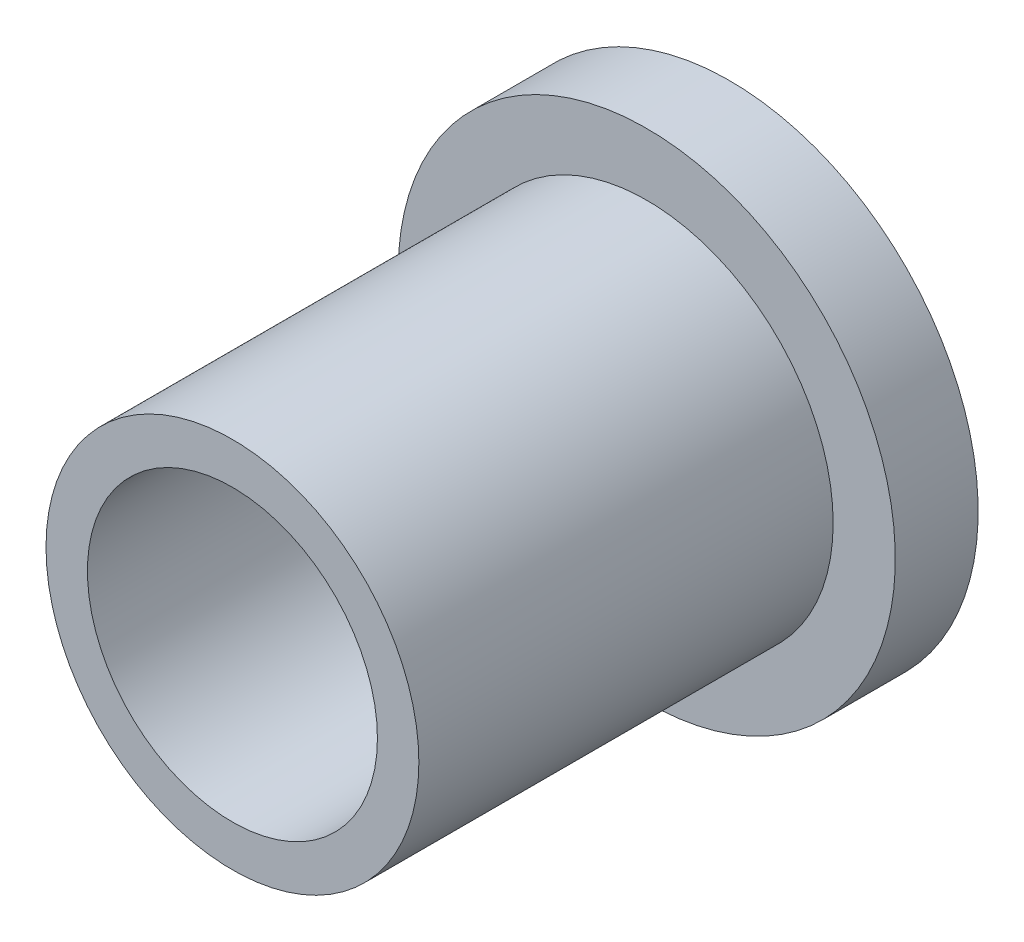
from build123d import *

# Parameters (mm, degrees)
ESQUISSE1_R      = 2.25
ESQUISSE1_R_2    = 1.75
EXTRUSION1_DEPTH = 6
ESQUISSE2_R      = 3
ESQUISSE2_R_2    = 1.75
EXTRUSION2_DEPTH = 1


with BuildPart() as part:
    # Esquisse1 → Extrusion1 (new body)
    with BuildSketch(Plane.XY):
        Circle(ESQUISSE1_R)
        Circle(ESQUISSE1_R_2, mode=Mode.SUBTRACT)
    extrude(amount=EXTRUSION1_DEPTH)

    # Esquisse2 → Extrusion2 (add)
    with BuildSketch(Plane(origin=(0, 0, 0), x_dir=(-1, 0, 0), z_dir=(0, 0, -1))):
        Circle(ESQUISSE2_R)
        with Locations(Location((0, 0, 0), (0, 0, 180))):
            Circle(ESQUISSE2_R_2, mode=Mode.SUBTRACT)
    extrude(amount=-EXTRUSION2_DEPTH)


solid = part.part
